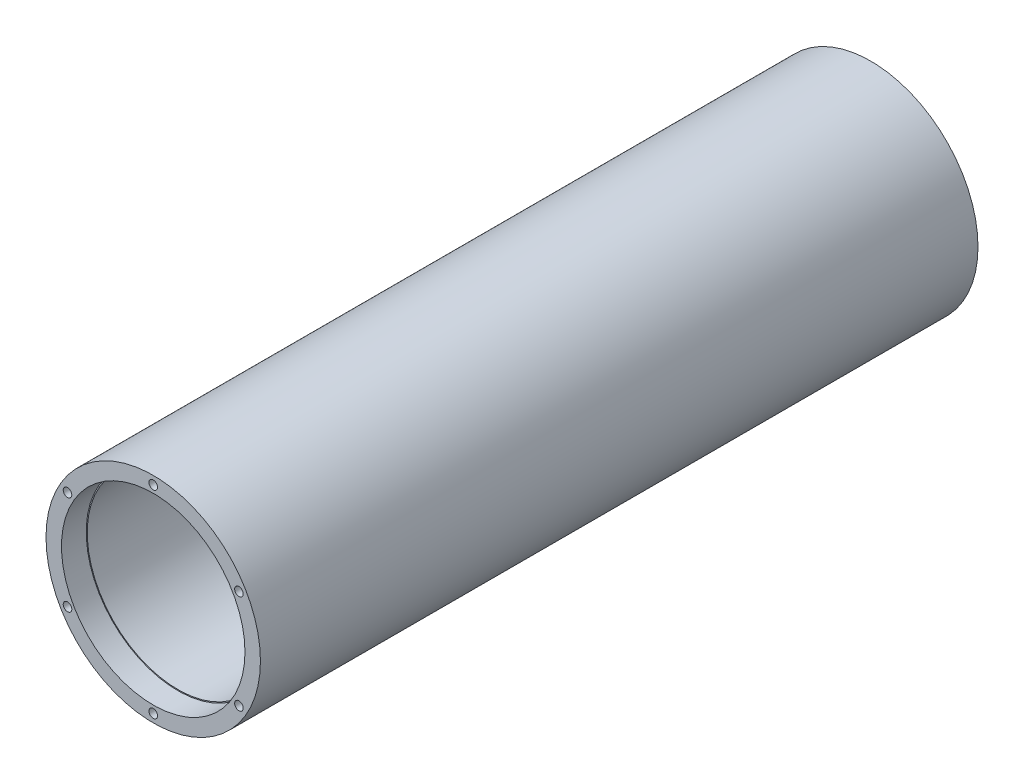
from build123d import *

# Parameters (mm, degrees)
SKETCH1_R          = 82.55
EXTRUDE1_DEPTH     = 577.85
SKETCH2_R          = 69.85
CUT_EXTRUDE1_DEPTH = 508
FILLET1_R          = 6.35
SKETCH3_R          = 70.6374
CUT_EXTRUDE2_DEPTH = 19.05
SKETCH4_R          = 3.302
CUT_EXTRUDE3_DEPTH = 25.4
CIRPATTERN1_COUNT  = 6
SKETCH5_R          = 7.62
CUT_EXTRUDE4_DEPTH = 590.524916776
SKETCH6_R          = 113.123997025
SKETCH6_R_2        = 38.1
CUT_EXTRUDE5_DEPTH = 25.4


with BuildPart() as part:
    # Sketch1 → Extrude1 (new body)
    with BuildSketch(Plane.XY):
        Circle(SKETCH1_R)
    extrude(amount=EXTRUDE1_DEPTH)

    # Sketch2 → Cut-Extrude1 (cut)
    with BuildSketch(Plane.XY.offset(577.85)):
        Circle(SKETCH2_R)
    extrude(amount=-CUT_EXTRUDE1_DEPTH, mode=Mode.SUBTRACT)

    # Fillet1
    fillet1_edges = [part.edges().sort_by_distance(p)[0] for p in [
        (-69.85, 0, 69.85),
    ]]
    fillet(fillet1_edges, radius=FILLET1_R)

    # Sketch3 → Cut-Extrude2 (cut)
    with BuildSketch(Plane.XY.offset(577.85)):
        Circle(SKETCH3_R)
    extrude(amount=-CUT_EXTRUDE2_DEPTH, mode=Mode.SUBTRACT)

    # Sketch4 → Cut-Extrude3 (cut)
    with BuildSketch(Plane.XY.offset(577.85)):
        with Locations((0, 76.2)):
            Circle(SKETCH4_R)
    cut_extrude3 = extrude(amount=-CUT_EXTRUDE3_DEPTH, mode=Mode.SUBTRACT)

    # CirPattern1: Cut-Extrude3 ×6 about axis
    cirpattern1_axis = Axis((0, 0, 0), (0, 0, 1))
    for i in range(1, CIRPATTERN1_COUNT):
        add(cut_extrude3.rotate(cirpattern1_axis, i * 360 / CIRPATTERN1_COUNT), mode=Mode.SUBTRACT)

    # Sketch5 → Cut-Extrude4 (cut, through all)
    with BuildSketch(Plane(origin=(0, 0, 0), x_dir=(-1, 0, 0), z_dir=(0, 0, -1))):
        Circle(SKETCH5_R)
    extrude(amount=-CUT_EXTRUDE4_DEPTH, mode=Mode.SUBTRACT)

    # Sketch6 → Cut-Extrude5 (cut)
    with BuildSketch(Plane(origin=(0, 0, 0), x_dir=(-1, 0, 0), z_dir=(0, 0, -1))):
        Circle(SKETCH6_R)
        Circle(SKETCH6_R_2, mode=Mode.SUBTRACT)
    extrude(amount=-CUT_EXTRUDE5_DEPTH, mode=Mode.SUBTRACT)


solid = part.part
